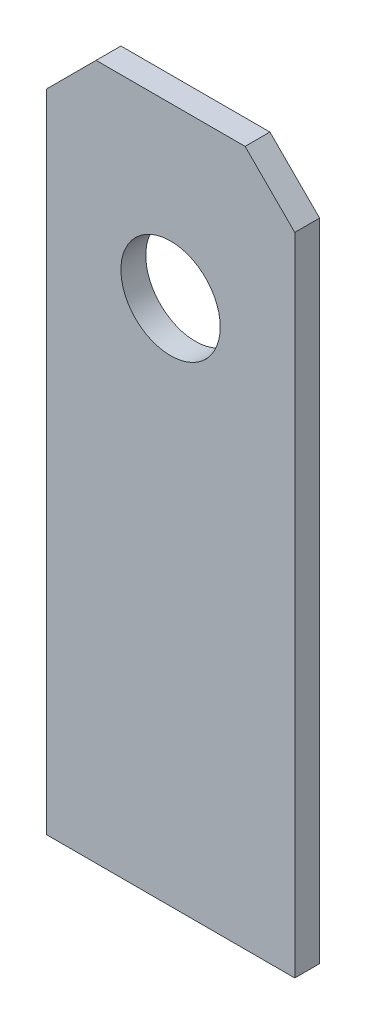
ISO-10303-21;
HEADER;
FILE_DESCRIPTION(('STEP AP214'),'2;1');
FILE_NAME('part.step','',(''),(''),'','','');
FILE_SCHEMA(('AUTOMOTIVE_DESIGN { 1 0 10303 214 1 1 1 1 }'));
ENDSEC;
DATA;
#1=APPLICATION_CONTEXT('core data for automotive mechanical design processes');
#2=APPLICATION_PROTOCOL_DEFINITION('international standard','automotive_design',2000,#1);
#3=PRODUCT_CONTEXT('',#1,'mechanical');
#4=PRODUCT('Part','Part','',(#3));
#5=PRODUCT_RELATED_PRODUCT_CATEGORY('part','',(#4));
#6=PRODUCT_DEFINITION_FORMATION('','',#4);
#7=PRODUCT_DEFINITION_CONTEXT('part definition',#1,'design');
#8=PRODUCT_DEFINITION('design','',#6,#7);
#9=PRODUCT_DEFINITION_SHAPE('','',#8);
#10=(LENGTH_UNIT() NAMED_UNIT(*) SI_UNIT(.MILLI.,.METRE.));
#11=(NAMED_UNIT(*) PLANE_ANGLE_UNIT() SI_UNIT($,.RADIAN.));
#12=(NAMED_UNIT(*) SI_UNIT($,.STERADIAN.) SOLID_ANGLE_UNIT());
#13=UNCERTAINTY_MEASURE_WITH_UNIT(LENGTH_MEASURE(1.E-05),#10,'distance_accuracy_value','');
#14=(GEOMETRIC_REPRESENTATION_CONTEXT(3) GLOBAL_UNCERTAINTY_ASSIGNED_CONTEXT((#13)) GLOBAL_UNIT_ASSIGNED_CONTEXT((#10,
#11,#12)) REPRESENTATION_CONTEXT('',''));
#15=CARTESIAN_POINT('',(0.,0.,0.));
#16=DIRECTION('',(0.,0.,1.));
#17=DIRECTION('',(1.,0.,0.));
#18=AXIS2_PLACEMENT_3D('',#15,#16,#17);
#19=CARTESIAN_POINT('',(0.,140.,5.));
#20=DIRECTION('',(0.,0.,-1.));
#21=DIRECTION('',(-1.,0.,0.));
#22=AXIS2_PLACEMENT_3D('',#19,#20,#21);
#23=PLANE('',#22);
#24=DIRECTION('',(-1.,0.,0.));
#25=VECTOR('',#24,1.);
#26=CARTESIAN_POINT('',(0.,140.,5.));
#27=LINE('',#26,#25);
#28=CARTESIAN_POINT('',(40.,140.,5.));
#29=VERTEX_POINT('',#28);
#30=CARTESIAN_POINT('',(10.,140.,5.));
#31=VERTEX_POINT('',#30);
#32=EDGE_CURVE('E113',#29,#31,#27,.T.);
#33=ORIENTED_EDGE('',*,*,#32,.T.);
#34=DIRECTION('',(0.707106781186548,0.707106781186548,0.));
#35=VECTOR('',#34,1.);
#36=CARTESIAN_POINT('',(0.,130.,5.));
#37=LINE('',#36,#35);
#38=CARTESIAN_POINT('',(0.,130.,5.));
#39=VERTEX_POINT('',#38);
#40=EDGE_CURVE('E39',#31,#39,#37,.F.);
#41=ORIENTED_EDGE('',*,*,#40,.T.);
#42=DIRECTION('',(0.,-1.,0.));
#43=VECTOR('',#42,1.);
#44=CARTESIAN_POINT('',(0.,0.,5.));
#45=LINE('',#44,#43);
#46=CARTESIAN_POINT('',(0.,0.,5.));
#47=VERTEX_POINT('',#46);
#48=EDGE_CURVE('E128',#39,#47,#45,.T.);
#49=ORIENTED_EDGE('',*,*,#48,.T.);
#50=DIRECTION('',(1.,0.,0.));
#51=VECTOR('',#50,1.);
#52=CARTESIAN_POINT('',(0.,0.,5.));
#53=LINE('',#52,#51);
#54=CARTESIAN_POINT('',(50.,0.,5.));
#55=VERTEX_POINT('',#54);
#56=EDGE_CURVE('E108',#47,#55,#53,.T.);
#57=ORIENTED_EDGE('',*,*,#56,.T.);
#58=DIRECTION('',(0.,1.,0.));
#59=VECTOR('',#58,1.);
#60=CARTESIAN_POINT('',(50.,0.,5.));
#61=LINE('',#60,#59);
#62=CARTESIAN_POINT('',(50.,130.,5.));
#63=VERTEX_POINT('',#62);
#64=EDGE_CURVE('E140',#55,#63,#61,.T.);
#65=ORIENTED_EDGE('',*,*,#64,.T.);
#66=DIRECTION('',(0.707106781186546,-0.707106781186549,0.));
#67=VECTOR('',#66,1.);
#68=CARTESIAN_POINT('',(40.,140.,5.));
#69=LINE('',#68,#67);
#70=EDGE_CURVE('E124',#63,#29,#69,.F.);
#71=ORIENTED_EDGE('',*,*,#70,.T.);
#72=EDGE_LOOP('',(#33,#41,#49,#57,#65,#71));
#73=FACE_BOUND('',#72,.T.);
#74=CARTESIAN_POINT('',(25.,106.,5.));
#75=DIRECTION('',(0.,0.,1.));
#76=DIRECTION('',(1.,0.,0.));
#77=AXIS2_PLACEMENT_3D('',#74,#75,#76);
#78=CIRCLE('',#77,10.);
#79=CARTESIAN_POINT('',(35.,106.,5.));
#80=VERTEX_POINT('',#79);
#81=EDGE_CURVE('E96',#80,#80,#78,.T.);
#82=ORIENTED_EDGE('',*,*,#81,.F.);
#83=EDGE_LOOP('',(#82));
#84=FACE_BOUND('',#83,.T.);
#85=ADVANCED_FACE('F31',(#73,#84),#23,.F.);
#86=CARTESIAN_POINT('',(0.,140.,0.));
#87=DIRECTION('',(0.,0.,-1.));
#88=DIRECTION('',(-1.,0.,0.));
#89=AXIS2_PLACEMENT_3D('',#86,#87,#88);
#90=PLANE('',#89);
#91=DIRECTION('',(0.,-1.,0.));
#92=VECTOR('',#91,1.);
#93=CARTESIAN_POINT('',(0.,0.,0.));
#94=LINE('',#93,#92);
#95=CARTESIAN_POINT('',(0.,130.,0.));
#96=VERTEX_POINT('',#95);
#97=CARTESIAN_POINT('',(0.,0.,0.));
#98=VERTEX_POINT('',#97);
#99=EDGE_CURVE('E87',#96,#98,#94,.T.);
#100=ORIENTED_EDGE('',*,*,#99,.F.);
#101=DIRECTION('',(-0.707106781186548,-0.707106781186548,0.));
#102=VECTOR('',#101,1.);
#103=CARTESIAN_POINT('',(5.,135.,0.));
#104=LINE('',#103,#102);
#105=CARTESIAN_POINT('',(10.,140.,0.));
#106=VERTEX_POINT('',#105);
#107=EDGE_CURVE('E118',#96,#106,#104,.F.);
#108=ORIENTED_EDGE('',*,*,#107,.T.);
#109=DIRECTION('',(-1.,0.,0.));
#110=VECTOR('',#109,1.);
#111=CARTESIAN_POINT('',(0.,140.,0.));
#112=LINE('',#111,#110);
#113=CARTESIAN_POINT('',(40.,140.,0.));
#114=VERTEX_POINT('',#113);
#115=EDGE_CURVE('E130',#114,#106,#112,.T.);
#116=ORIENTED_EDGE('',*,*,#115,.F.);
#117=DIRECTION('',(-0.707106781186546,0.707106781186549,0.));
#118=VECTOR('',#117,1.);
#119=CARTESIAN_POINT('',(20.0000000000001,160.,0.));
#120=LINE('',#119,#118);
#121=CARTESIAN_POINT('',(50.,130.,0.));
#122=VERTEX_POINT('',#121);
#123=EDGE_CURVE('E111',#114,#122,#120,.F.);
#124=ORIENTED_EDGE('',*,*,#123,.T.);
#125=DIRECTION('',(0.,1.,0.));
#126=VECTOR('',#125,1.);
#127=CARTESIAN_POINT('',(50.,0.,0.));
#128=LINE('',#127,#126);
#129=CARTESIAN_POINT('',(50.,0.,0.));
#130=VERTEX_POINT('',#129);
#131=EDGE_CURVE('E101',#130,#122,#128,.T.);
#132=ORIENTED_EDGE('',*,*,#131,.F.);
#133=DIRECTION('',(1.,0.,0.));
#134=VECTOR('',#133,1.);
#135=CARTESIAN_POINT('',(0.,0.,0.));
#136=LINE('',#135,#134);
#137=EDGE_CURVE('E95',#98,#130,#136,.T.);
#138=ORIENTED_EDGE('',*,*,#137,.F.);
#139=EDGE_LOOP('',(#100,#108,#116,#124,#132,#138));
#140=FACE_BOUND('',#139,.T.);
#141=CARTESIAN_POINT('',(25.,106.,0.));
#142=DIRECTION('',(0.,0.,1.));
#143=DIRECTION('',(1.,0.,0.));
#144=AXIS2_PLACEMENT_3D('',#141,#142,#143);
#145=CIRCLE('',#144,10.);
#146=CARTESIAN_POINT('',(35.,106.,0.));
#147=VERTEX_POINT('',#146);
#148=EDGE_CURVE('E222',#147,#147,#145,.T.);
#149=ORIENTED_EDGE('',*,*,#148,.T.);
#150=EDGE_LOOP('',(#149));
#151=FACE_BOUND('',#150,.T.);
#152=ADVANCED_FACE('F99',(#140,#151),#90,.T.);
#153=CARTESIAN_POINT('',(0.,0.,5.));
#154=DIRECTION('',(1.,0.,0.));
#155=DIRECTION('',(0.,0.,-1.));
#156=AXIS2_PLACEMENT_3D('',#153,#154,#155);
#157=PLANE('',#156);
#158=ORIENTED_EDGE('',*,*,#48,.F.);
#159=DIRECTION('',(0.,0.,-1.));
#160=VECTOR('',#159,1.);
#161=CARTESIAN_POINT('',(0.,130.,5.));
#162=LINE('',#161,#160);
#163=EDGE_CURVE('E93',#39,#96,#162,.T.);
#164=ORIENTED_EDGE('',*,*,#163,.T.);
#165=ORIENTED_EDGE('',*,*,#99,.T.);
#166=DIRECTION('',(0.,0.,-1.));
#167=VECTOR('',#166,1.);
#168=CARTESIAN_POINT('',(0.,0.,5.));
#169=LINE('',#168,#167);
#170=EDGE_CURVE('E91',#47,#98,#169,.T.);
#171=ORIENTED_EDGE('',*,*,#170,.F.);
#172=EDGE_LOOP('',(#158,#164,#165,#171));
#173=FACE_BOUND('',#172,.T.);
#174=ADVANCED_FACE('F33',(#173),#157,.F.);
#175=CARTESIAN_POINT('',(0.,0.,5.));
#176=DIRECTION('',(0.,1.,0.));
#177=DIRECTION('',(0.,0.,1.));
#178=AXIS2_PLACEMENT_3D('',#175,#176,#177);
#179=PLANE('',#178);
#180=ORIENTED_EDGE('',*,*,#137,.T.);
#181=DIRECTION('',(0.,0.,-1.));
#182=VECTOR('',#181,1.);
#183=CARTESIAN_POINT('',(50.,0.,5.));
#184=LINE('',#183,#182);
#185=EDGE_CURVE('E109',#55,#130,#184,.T.);
#186=ORIENTED_EDGE('',*,*,#185,.F.);
#187=ORIENTED_EDGE('',*,*,#56,.F.);
#188=ORIENTED_EDGE('',*,*,#170,.T.);
#189=EDGE_LOOP('',(#180,#186,#187,#188));
#190=FACE_BOUND('',#189,.T.);
#191=ADVANCED_FACE('F107',(#190),#179,.F.);
#192=CARTESIAN_POINT('',(50.,0.,5.));
#193=DIRECTION('',(-1.,0.,0.));
#194=DIRECTION('',(0.,0.,1.));
#195=AXIS2_PLACEMENT_3D('',#192,#193,#194);
#196=PLANE('',#195);
#197=ORIENTED_EDGE('',*,*,#131,.T.);
#198=DIRECTION('',(0.,0.,1.));
#199=VECTOR('',#198,1.);
#200=CARTESIAN_POINT('',(50.,130.,5.));
#201=LINE('',#200,#199);
#202=EDGE_CURVE('E11',#122,#63,#201,.T.);
#203=ORIENTED_EDGE('',*,*,#202,.T.);
#204=ORIENTED_EDGE('',*,*,#64,.F.);
#205=ORIENTED_EDGE('',*,*,#185,.T.);
#206=EDGE_LOOP('',(#197,#203,#204,#205));
#207=FACE_BOUND('',#206,.T.);
#208=ADVANCED_FACE('F144',(#207),#196,.F.);
#209=CARTESIAN_POINT('',(0.,140.,5.));
#210=DIRECTION('',(0.,-1.,0.));
#211=DIRECTION('',(0.,0.,-1.));
#212=AXIS2_PLACEMENT_3D('',#209,#210,#211);
#213=PLANE('',#212);
#214=ORIENTED_EDGE('',*,*,#115,.T.);
#215=DIRECTION('',(0.,0.,1.));
#216=VECTOR('',#215,1.);
#217=CARTESIAN_POINT('',(10.,140.,5.));
#218=LINE('',#217,#216);
#219=EDGE_CURVE('E52',#106,#31,#218,.T.);
#220=ORIENTED_EDGE('',*,*,#219,.T.);
#221=ORIENTED_EDGE('',*,*,#32,.F.);
#222=DIRECTION('',(0.,0.,-1.));
#223=VECTOR('',#222,1.);
#224=CARTESIAN_POINT('',(40.,140.,5.));
#225=LINE('',#224,#223);
#226=EDGE_CURVE('E120',#29,#114,#225,.T.);
#227=ORIENTED_EDGE('',*,*,#226,.T.);
#228=EDGE_LOOP('',(#214,#220,#221,#227));
#229=FACE_BOUND('',#228,.T.);
#230=ADVANCED_FACE('F134',(#229),#213,.F.);
#231=CARTESIAN_POINT('',(25.,106.,5.));
#232=DIRECTION('',(0.,0.,-1.));
#233=DIRECTION('',(-1.,0.,0.));
#234=AXIS2_PLACEMENT_3D('',#231,#232,#233);
#235=CYLINDRICAL_SURFACE('',#234,10.);
#236=ORIENTED_EDGE('',*,*,#81,.T.);
#237=EDGE_LOOP('',(#236));
#238=FACE_BOUND('',#237,.T.);
#239=ORIENTED_EDGE('',*,*,#148,.F.);
#240=EDGE_LOOP('',(#239));
#241=FACE_BOUND('',#240,.T.);
#242=ADVANCED_FACE('F151',(#238,#241),#235,.F.);
#243=CARTESIAN_POINT('',(0.,130.,5.));
#244=DIRECTION('',(0.707106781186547,-0.707106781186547,0.));
#245=DIRECTION('',(0.707106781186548,0.707106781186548,0.));
#246=AXIS2_PLACEMENT_3D('',#243,#244,#245);
#247=PLANE('',#246);
#248=ORIENTED_EDGE('',*,*,#40,.F.);
#249=ORIENTED_EDGE('',*,*,#219,.F.);
#250=ORIENTED_EDGE('',*,*,#107,.F.);
#251=ORIENTED_EDGE('',*,*,#163,.F.);
#252=EDGE_LOOP('',(#248,#249,#250,#251));
#253=FACE_BOUND('',#252,.T.);
#254=ADVANCED_FACE('F132',(#253),#247,.F.);
#255=CARTESIAN_POINT('',(40.,140.,5.));
#256=DIRECTION('',(-0.707106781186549,-0.707106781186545,0.));
#257=DIRECTION('',(0.707106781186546,-0.707106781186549,0.));
#258=AXIS2_PLACEMENT_3D('',#255,#256,#257);
#259=PLANE('',#258);
#260=ORIENTED_EDGE('',*,*,#70,.F.);
#261=ORIENTED_EDGE('',*,*,#202,.F.);
#262=ORIENTED_EDGE('',*,*,#123,.F.);
#263=ORIENTED_EDGE('',*,*,#226,.F.);
#264=EDGE_LOOP('',(#260,#261,#262,#263));
#265=FACE_BOUND('',#264,.T.);
#266=ADVANCED_FACE('F143',(#265),#259,.F.);
#267=CLOSED_SHELL('',(#85,#152,#174,#191,#208,#230,#242,#254,#266));
#268=MANIFOLD_SOLID_BREP('B2',#267);
#269=ADVANCED_BREP_SHAPE_REPRESENTATION('',(#18,#268),#14);
#270=SHAPE_DEFINITION_REPRESENTATION(#9,#269);
ENDSEC;
END-ISO-10303-21;
